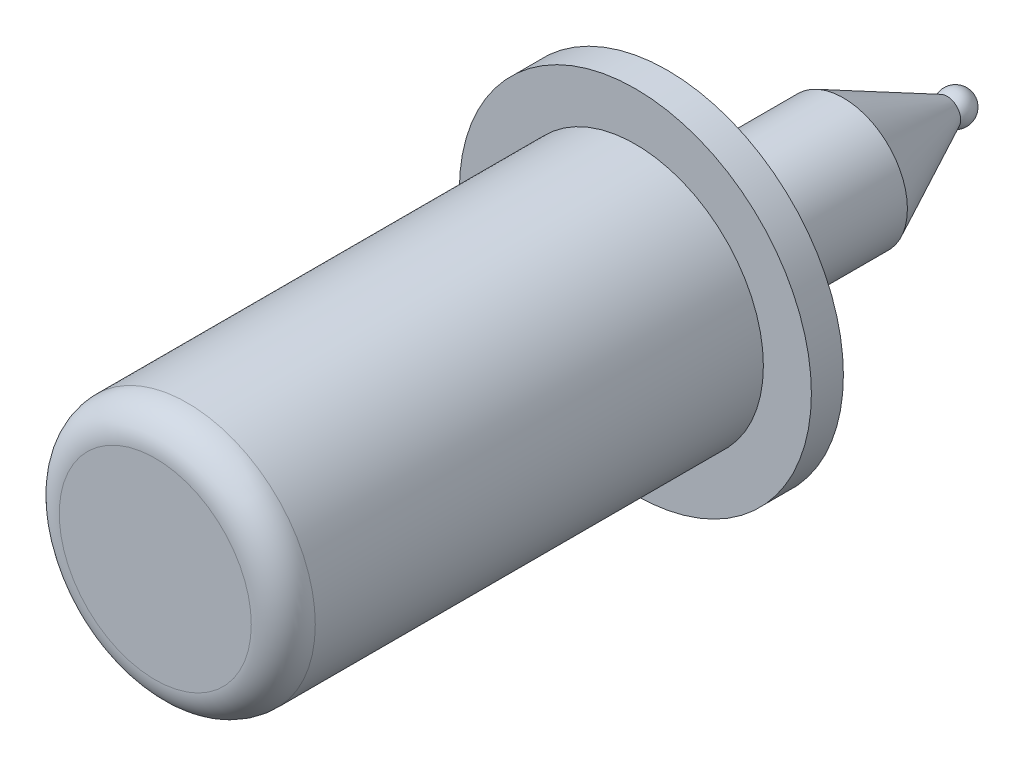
from build123d import *


with BuildPart() as part:
    # Sketch5 → Revolve1 (revolve)
    with BuildSketch(Plane(origin=(0, 0, 0), x_dir=(0, 0, -1), z_dir=(1, 0, 0)), mode=Mode.PRIVATE) as revolve1_sk:
        with BuildLine():
            Line((0, 0), (0, 3))
            ThreePointArc((0, 3), (0.292893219, 3.707106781), (1, 4))
            Line((1, 4), (15, 4))
            Line((15, 4), (15, 5.5))
            Line((15, 5.5), (16, 5.5))
            Line((16, 5.5), (16, 2))
            Line((16, 2), (21.5, 2))
            Line((21.5, 2), (24.738971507, 0.426455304))
            ThreePointArc((24.738971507, 0.426455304), (25.24442356, 0.436184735), (25.5, 0))
            Line((25.5, 0), (0, 0))
        make_face()
    revolve(revolve1_sk.sketch.rotate(Axis((0, 0, 0), (0, 0, -1)), 90), axis=Axis((0, 0, 0), (0, 0, -1)))


solid = part.part
